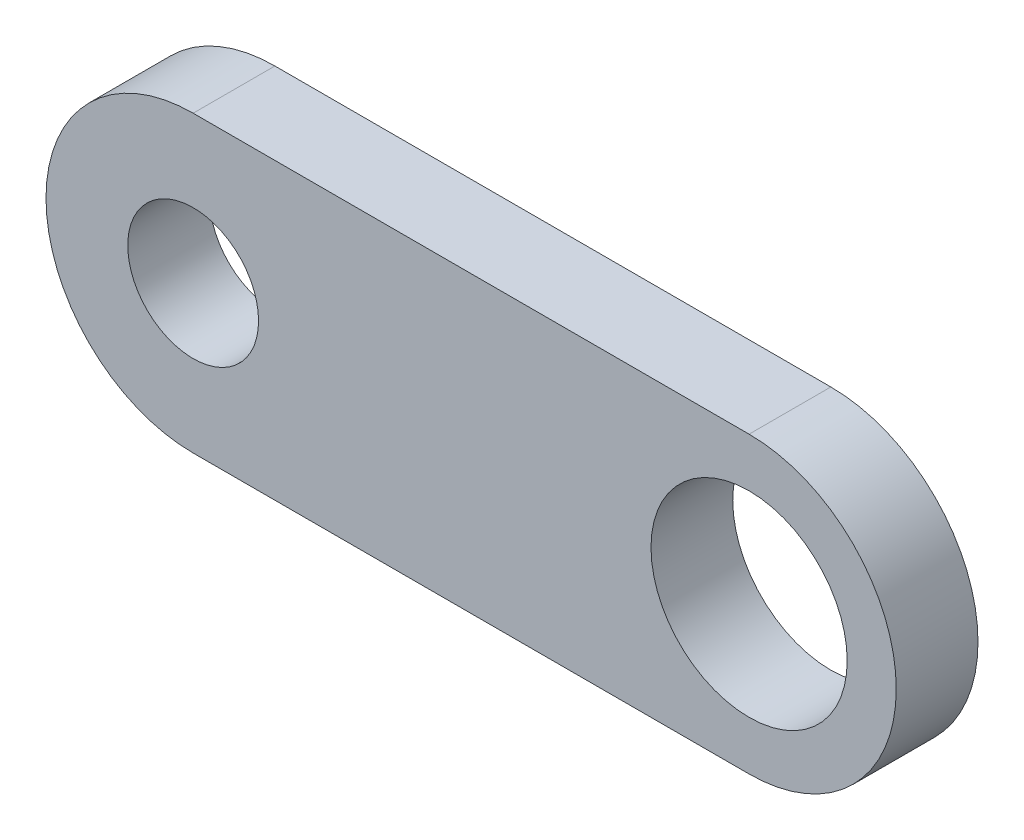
ISO-10303-21;
HEADER;
FILE_DESCRIPTION(('STEP AP214'),'2;1');
FILE_NAME('part.step','',(''),(''),'','','');
FILE_SCHEMA(('AUTOMOTIVE_DESIGN { 1 0 10303 214 1 1 1 1 }'));
ENDSEC;
DATA;
#1=APPLICATION_CONTEXT('core data for automotive mechanical design processes');
#2=APPLICATION_PROTOCOL_DEFINITION('international standard','automotive_design',2000,#1);
#3=PRODUCT_CONTEXT('',#1,'mechanical');
#4=PRODUCT('Part','Part','',(#3));
#5=PRODUCT_RELATED_PRODUCT_CATEGORY('part','',(#4));
#6=PRODUCT_DEFINITION_FORMATION('','',#4);
#7=PRODUCT_DEFINITION_CONTEXT('part definition',#1,'design');
#8=PRODUCT_DEFINITION('design','',#6,#7);
#9=PRODUCT_DEFINITION_SHAPE('','',#8);
#10=(LENGTH_UNIT() NAMED_UNIT(*) SI_UNIT(.MILLI.,.METRE.));
#11=(NAMED_UNIT(*) PLANE_ANGLE_UNIT() SI_UNIT($,.RADIAN.));
#12=(NAMED_UNIT(*) SI_UNIT($,.STERADIAN.) SOLID_ANGLE_UNIT());
#13=UNCERTAINTY_MEASURE_WITH_UNIT(LENGTH_MEASURE(1.E-05),#10,'distance_accuracy_value','');
#14=(GEOMETRIC_REPRESENTATION_CONTEXT(3) GLOBAL_UNCERTAINTY_ASSIGNED_CONTEXT((#13)) GLOBAL_UNIT_ASSIGNED_CONTEXT((#10,
#11,#12)) REPRESENTATION_CONTEXT('',''));
#15=CARTESIAN_POINT('',(0.,0.,0.));
#16=DIRECTION('',(0.,0.,1.));
#17=DIRECTION('',(1.,0.,0.));
#18=AXIS2_PLACEMENT_3D('',#15,#16,#17);
#19=CARTESIAN_POINT('',(0.,0.,5.));
#20=DIRECTION('',(0.,0.,1.));
#21=DIRECTION('',(1.,0.,0.));
#22=AXIS2_PLACEMENT_3D('',#19,#20,#21);
#23=PLANE('',#22);
#24=CARTESIAN_POINT('',(0.,0.,5.));
#25=DIRECTION('',(0.,0.,1.));
#26=DIRECTION('',(1.,0.,0.));
#27=AXIS2_PLACEMENT_3D('',#24,#25,#26);
#28=CIRCLE('',#27,4.);
#29=CARTESIAN_POINT('',(4.,0.,5.));
#30=VERTEX_POINT('',#29);
#31=EDGE_CURVE('E409',#30,#30,#28,.T.);
#32=ORIENTED_EDGE('',*,*,#31,.F.);
#33=EDGE_LOOP('',(#32));
#34=FACE_BOUND('',#33,.T.);
#35=CARTESIAN_POINT('',(0.,0.,5.));
#36=DIRECTION('',(0.,0.,1.));
#37=DIRECTION('',(1.,0.,0.));
#38=AXIS2_PLACEMENT_3D('',#35,#36,#37);
#39=CIRCLE('',#38,9.);
#40=CARTESIAN_POINT('',(0.,9.,5.));
#41=VERTEX_POINT('',#40);
#42=CARTESIAN_POINT('',(0.,-9.,5.));
#43=VERTEX_POINT('',#42);
#44=EDGE_CURVE('E419',#41,#43,#39,.T.);
#45=ORIENTED_EDGE('',*,*,#44,.T.);
#46=DIRECTION('',(1.,0.,0.));
#47=VECTOR('',#46,1.);
#48=CARTESIAN_POINT('',(0.,-9.,5.));
#49=LINE('',#48,#47);
#50=CARTESIAN_POINT('',(34.,-9.,5.));
#51=VERTEX_POINT('',#50);
#52=EDGE_CURVE('E404',#43,#51,#49,.T.);
#53=ORIENTED_EDGE('',*,*,#52,.T.);
#54=CARTESIAN_POINT('',(34.,0.,5.));
#55=DIRECTION('',(0.,0.,1.));
#56=DIRECTION('',(1.,0.,0.));
#57=AXIS2_PLACEMENT_3D('',#54,#55,#56);
#58=CIRCLE('',#57,9.);
#59=CARTESIAN_POINT('',(34.,9.,5.));
#60=VERTEX_POINT('',#59);
#61=EDGE_CURVE('E370',#51,#60,#58,.T.);
#62=ORIENTED_EDGE('',*,*,#61,.T.);
#63=DIRECTION('',(-1.,0.,0.));
#64=VECTOR('',#63,1.);
#65=CARTESIAN_POINT('',(0.,9.,5.));
#66=LINE('',#65,#64);
#67=EDGE_CURVE('E365',#60,#41,#66,.T.);
#68=ORIENTED_EDGE('',*,*,#67,.T.);
#69=EDGE_LOOP('',(#45,#53,#62,#68));
#70=FACE_BOUND('',#69,.T.);
#71=CARTESIAN_POINT('',(34.,0.,5.));
#72=DIRECTION('',(0.,0.,1.));
#73=DIRECTION('',(1.,0.,0.));
#74=AXIS2_PLACEMENT_3D('',#71,#72,#73);
#75=CIRCLE('',#74,6.);
#76=CARTESIAN_POINT('',(40.,0.,5.));
#77=VERTEX_POINT('',#76);
#78=EDGE_CURVE('E437',#77,#77,#75,.T.);
#79=ORIENTED_EDGE('',*,*,#78,.F.);
#80=EDGE_LOOP('',(#79));
#81=FACE_BOUND('',#80,.T.);
#82=ADVANCED_FACE('F350',(#34,#70,#81),#23,.T.);
#83=CARTESIAN_POINT('',(0.,0.,0.));
#84=DIRECTION('',(0.,0.,1.));
#85=DIRECTION('',(1.,0.,0.));
#86=AXIS2_PLACEMENT_3D('',#83,#84,#85);
#87=PLANE('',#86);
#88=CARTESIAN_POINT('',(0.,0.,0.));
#89=DIRECTION('',(0.,0.,1.));
#90=DIRECTION('',(1.,0.,0.));
#91=AXIS2_PLACEMENT_3D('',#88,#89,#90);
#92=CIRCLE('',#91,4.);
#93=CARTESIAN_POINT('',(4.,0.,0.));
#94=VERTEX_POINT('',#93);
#95=EDGE_CURVE('E412',#94,#94,#92,.T.);
#96=ORIENTED_EDGE('',*,*,#95,.T.);
#97=EDGE_LOOP('',(#96));
#98=FACE_BOUND('',#97,.T.);
#99=CARTESIAN_POINT('',(0.,0.,0.));
#100=DIRECTION('',(0.,0.,1.));
#101=DIRECTION('',(1.,0.,0.));
#102=AXIS2_PLACEMENT_3D('',#99,#100,#101);
#103=CIRCLE('',#102,9.);
#104=CARTESIAN_POINT('',(0.,9.,0.));
#105=VERTEX_POINT('',#104);
#106=CARTESIAN_POINT('',(0.,-9.,0.));
#107=VERTEX_POINT('',#106);
#108=EDGE_CURVE('E396',#105,#107,#103,.T.);
#109=ORIENTED_EDGE('',*,*,#108,.F.);
#110=DIRECTION('',(-1.,0.,0.));
#111=VECTOR('',#110,1.);
#112=CARTESIAN_POINT('',(0.,9.,0.));
#113=LINE('',#112,#111);
#114=CARTESIAN_POINT('',(34.,9.,0.));
#115=VERTEX_POINT('',#114);
#116=EDGE_CURVE('E417',#115,#105,#113,.T.);
#117=ORIENTED_EDGE('',*,*,#116,.F.);
#118=CARTESIAN_POINT('',(34.,0.,0.));
#119=DIRECTION('',(0.,0.,1.));
#120=DIRECTION('',(1.,0.,0.));
#121=AXIS2_PLACEMENT_3D('',#118,#119,#120);
#122=CIRCLE('',#121,9.);
#123=CARTESIAN_POINT('',(34.,-9.,0.));
#124=VERTEX_POINT('',#123);
#125=EDGE_CURVE('E397',#124,#115,#122,.T.);
#126=ORIENTED_EDGE('',*,*,#125,.F.);
#127=DIRECTION('',(1.,0.,0.));
#128=VECTOR('',#127,1.);
#129=CARTESIAN_POINT('',(0.,-9.,0.));
#130=LINE('',#129,#128);
#131=EDGE_CURVE('E391',#107,#124,#130,.T.);
#132=ORIENTED_EDGE('',*,*,#131,.F.);
#133=EDGE_LOOP('',(#109,#117,#126,#132));
#134=FACE_BOUND('',#133,.T.);
#135=CARTESIAN_POINT('',(34.,0.,0.));
#136=DIRECTION('',(0.,0.,1.));
#137=DIRECTION('',(1.,0.,0.));
#138=AXIS2_PLACEMENT_3D('',#135,#136,#137);
#139=CIRCLE('',#138,6.);
#140=CARTESIAN_POINT('',(40.,0.,0.));
#141=VERTEX_POINT('',#140);
#142=EDGE_CURVE('E439',#141,#141,#139,.T.);
#143=ORIENTED_EDGE('',*,*,#142,.T.);
#144=EDGE_LOOP('',(#143));
#145=FACE_BOUND('',#144,.T.);
#146=ADVANCED_FACE('F392',(#98,#134,#145),#87,.F.);
#147=CARTESIAN_POINT('',(0.,0.,5.));
#148=DIRECTION('',(0.,0.,-1.));
#149=DIRECTION('',(-1.,0.,0.));
#150=AXIS2_PLACEMENT_3D('',#147,#148,#149);
#151=CYLINDRICAL_SURFACE('',#150,9.);
#152=ORIENTED_EDGE('',*,*,#108,.T.);
#153=DIRECTION('',(0.,0.,-1.));
#154=VECTOR('',#153,1.);
#155=CARTESIAN_POINT('',(0.,-9.,5.));
#156=LINE('',#155,#154);
#157=EDGE_CURVE('E11',#43,#107,#156,.T.);
#158=ORIENTED_EDGE('',*,*,#157,.F.);
#159=ORIENTED_EDGE('',*,*,#44,.F.);
#160=DIRECTION('',(0.,0.,-1.));
#161=VECTOR('',#160,1.);
#162=CARTESIAN_POINT('',(0.,9.,5.));
#163=LINE('',#162,#161);
#164=EDGE_CURVE('E408',#41,#105,#163,.T.);
#165=ORIENTED_EDGE('',*,*,#164,.T.);
#166=EDGE_LOOP('',(#152,#158,#159,#165));
#167=FACE_BOUND('',#166,.T.);
#168=ADVANCED_FACE('F352',(#167),#151,.T.);
#169=CARTESIAN_POINT('',(0.,-9.,5.));
#170=DIRECTION('',(0.,1.,0.));
#171=DIRECTION('',(-1.,0.,0.));
#172=AXIS2_PLACEMENT_3D('',#169,#170,#171);
#173=PLANE('',#172);
#174=ORIENTED_EDGE('',*,*,#131,.T.);
#175=DIRECTION('',(0.,0.,-1.));
#176=VECTOR('',#175,1.);
#177=CARTESIAN_POINT('',(34.,-9.,5.));
#178=LINE('',#177,#176);
#179=EDGE_CURVE('E358',#51,#124,#178,.T.);
#180=ORIENTED_EDGE('',*,*,#179,.F.);
#181=ORIENTED_EDGE('',*,*,#52,.F.);
#182=ORIENTED_EDGE('',*,*,#157,.T.);
#183=EDGE_LOOP('',(#174,#180,#181,#182));
#184=FACE_BOUND('',#183,.T.);
#185=ADVANCED_FACE('F403',(#184),#173,.F.);
#186=CARTESIAN_POINT('',(34.,0.,5.));
#187=DIRECTION('',(0.,0.,-1.));
#188=DIRECTION('',(-1.,0.,0.));
#189=AXIS2_PLACEMENT_3D('',#186,#187,#188);
#190=CYLINDRICAL_SURFACE('',#189,9.);
#191=ORIENTED_EDGE('',*,*,#125,.T.);
#192=DIRECTION('',(0.,0.,-1.));
#193=VECTOR('',#192,1.);
#194=CARTESIAN_POINT('',(34.,9.,5.));
#195=LINE('',#194,#193);
#196=EDGE_CURVE('E425',#60,#115,#195,.T.);
#197=ORIENTED_EDGE('',*,*,#196,.F.);
#198=ORIENTED_EDGE('',*,*,#61,.F.);
#199=ORIENTED_EDGE('',*,*,#179,.T.);
#200=EDGE_LOOP('',(#191,#197,#198,#199));
#201=FACE_BOUND('',#200,.T.);
#202=ADVANCED_FACE('F428',(#201),#190,.T.);
#203=CARTESIAN_POINT('',(0.,9.,5.));
#204=DIRECTION('',(0.,-1.,0.));
#205=DIRECTION('',(1.,0.,0.));
#206=AXIS2_PLACEMENT_3D('',#203,#204,#205);
#207=PLANE('',#206);
#208=ORIENTED_EDGE('',*,*,#116,.T.);
#209=ORIENTED_EDGE('',*,*,#164,.F.);
#210=ORIENTED_EDGE('',*,*,#67,.F.);
#211=ORIENTED_EDGE('',*,*,#196,.T.);
#212=EDGE_LOOP('',(#208,#209,#210,#211));
#213=FACE_BOUND('',#212,.T.);
#214=ADVANCED_FACE('F430',(#213),#207,.F.);
#215=CARTESIAN_POINT('',(0.,0.,5.));
#216=DIRECTION('',(0.,0.,-1.));
#217=DIRECTION('',(-1.,0.,0.));
#218=AXIS2_PLACEMENT_3D('',#215,#216,#217);
#219=CYLINDRICAL_SURFACE('',#218,4.);
#220=ORIENTED_EDGE('',*,*,#31,.T.);
#221=EDGE_LOOP('',(#220));
#222=FACE_BOUND('',#221,.T.);
#223=ORIENTED_EDGE('',*,*,#95,.F.);
#224=EDGE_LOOP('',(#223));
#225=FACE_BOUND('',#224,.T.);
#226=ADVANCED_FACE('F448',(#222,#225),#219,.F.);
#227=CARTESIAN_POINT('',(34.,0.,5.));
#228=DIRECTION('',(0.,0.,-1.));
#229=DIRECTION('',(-1.,0.,0.));
#230=AXIS2_PLACEMENT_3D('',#227,#228,#229);
#231=CYLINDRICAL_SURFACE('',#230,6.);
#232=ORIENTED_EDGE('',*,*,#78,.T.);
#233=EDGE_LOOP('',(#232));
#234=FACE_BOUND('',#233,.T.);
#235=ORIENTED_EDGE('',*,*,#142,.F.);
#236=EDGE_LOOP('',(#235));
#237=FACE_BOUND('',#236,.T.);
#238=ADVANCED_FACE('F446',(#234,#237),#231,.F.);
#239=CLOSED_SHELL('',(#82,#146,#168,#185,#202,#214,#226,#238));
#240=MANIFOLD_SOLID_BREP('B2',#239);
#241=ADVANCED_BREP_SHAPE_REPRESENTATION('',(#18,#240),#14);
#242=SHAPE_DEFINITION_REPRESENTATION(#9,#241);
ENDSEC;
END-ISO-10303-21;
